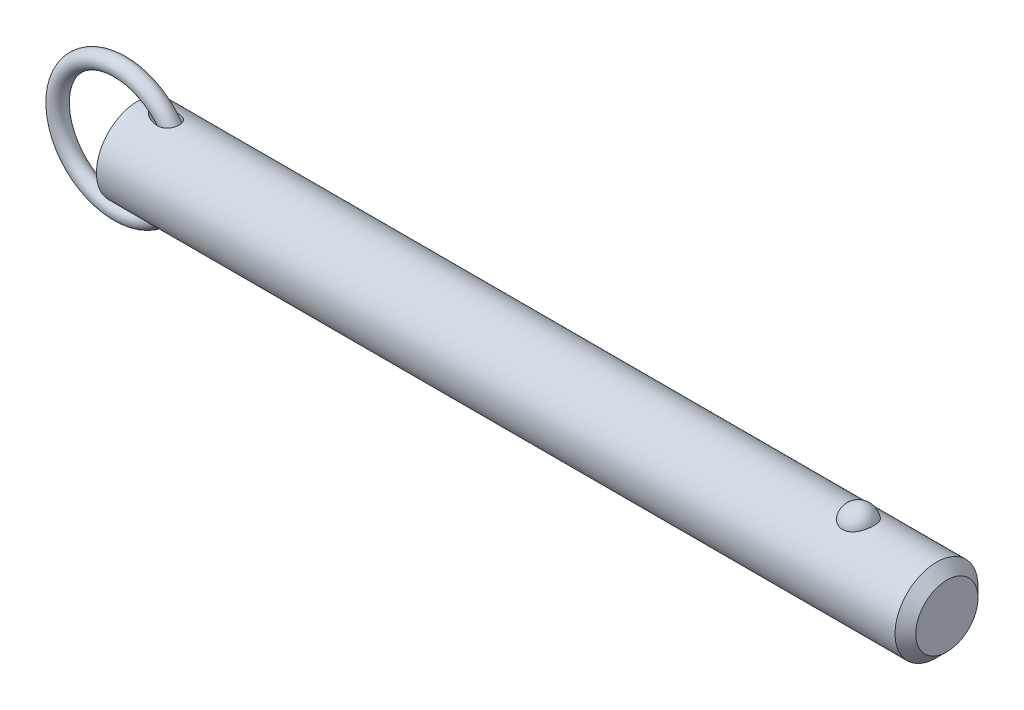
ISO-10303-21;
HEADER;
FILE_DESCRIPTION(('STEP AP214'),'2;1');
FILE_NAME('part.step','',(''),(''),'','','');
FILE_SCHEMA(('AUTOMOTIVE_DESIGN { 1 0 10303 214 1 1 1 1 }'));
ENDSEC;
DATA;
#1=APPLICATION_CONTEXT('core data for automotive mechanical design processes');
#2=APPLICATION_PROTOCOL_DEFINITION('international standard','automotive_design',2000,#1);
#3=PRODUCT_CONTEXT('',#1,'mechanical');
#4=PRODUCT('Part','Part','',(#3));
#5=PRODUCT_RELATED_PRODUCT_CATEGORY('part','',(#4));
#6=PRODUCT_DEFINITION_FORMATION('','',#4);
#7=PRODUCT_DEFINITION_CONTEXT('part definition',#1,'design');
#8=PRODUCT_DEFINITION('design','',#6,#7);
#9=PRODUCT_DEFINITION_SHAPE('','',#8);
#10=(LENGTH_UNIT() NAMED_UNIT(*) SI_UNIT(.MILLI.,.METRE.));
#11=(NAMED_UNIT(*) PLANE_ANGLE_UNIT() SI_UNIT($,.RADIAN.));
#12=(NAMED_UNIT(*) SI_UNIT($,.STERADIAN.) SOLID_ANGLE_UNIT());
#13=UNCERTAINTY_MEASURE_WITH_UNIT(LENGTH_MEASURE(1.E-05),#10,'distance_accuracy_value','');
#14=(GEOMETRIC_REPRESENTATION_CONTEXT(3) GLOBAL_UNCERTAINTY_ASSIGNED_CONTEXT((#13)) GLOBAL_UNIT_ASSIGNED_CONTEXT((#10,
#11,#12)) REPRESENTATION_CONTEXT('',''));
#15=CARTESIAN_POINT('',(0.,0.,0.));
#16=DIRECTION('',(0.,0.,1.));
#17=DIRECTION('',(1.,0.,0.));
#18=AXIS2_PLACEMENT_3D('',#15,#16,#17);
#19=CARTESIAN_POINT('',(-5.53898640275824,0.,0.));
#20=DIRECTION('',(0.,0.,1.));
#21=DIRECTION('',(1.,0.,0.));
#22=AXIS2_PLACEMENT_3D('',#19,#20,#21);
#23=TOROIDAL_SURFACE('',#22,19.05,2.54);
#24=CARTESIAN_POINT('',(16.0510135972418,0.,0.));
#25=VERTEX_POINT('',#24);
#26=VERTEX_LOOP('',#25);
#27=FACE_BOUND('',#26,.T.);
#28=ADVANCED_FACE('P0_F12',(#27),#23,.T.);
#29=CLOSED_SHELL('',(#28));
#30=MANIFOLD_SOLID_BREP('P0_B1',#29);
#31=CARTESIAN_POINT('',(0.,0.,0.));
#32=DIRECTION('',(1.,0.,0.));
#33=DIRECTION('',(0.,0.,-1.));
#34=AXIS2_PLACEMENT_3D('',#31,#32,#33);
#35=CYLINDRICAL_SURFACE('',#34,12.7);
#36=CARTESIAN_POINT('',(244.475,0.,0.));
#37=DIRECTION('',(1.,0.,0.));
#38=DIRECTION('',(0.,0.,-1.));
#39=AXIS2_PLACEMENT_3D('',#36,#37,#38);
#40=CIRCLE('',#39,12.7);
#41=CARTESIAN_POINT('',(244.475,0.,-12.7));
#42=VERTEX_POINT('',#41);
#43=EDGE_CURVE('P1_E89',#42,#42,#40,.T.);
#44=ORIENTED_EDGE('',*,*,#43,.F.);
#45=EDGE_LOOP('',(#44));
#46=FACE_BOUND('',#45,.T.);
#47=CARTESIAN_POINT('',(0.,0.,0.));
#48=DIRECTION('',(1.,0.,0.));
#49=DIRECTION('',(0.,0.,-1.));
#50=AXIS2_PLACEMENT_3D('',#47,#48,#49);
#51=CIRCLE('',#50,12.7);
#52=CARTESIAN_POINT('',(0.,0.,-12.7));
#53=VERTEX_POINT('',#52);
#54=EDGE_CURVE('P1_E52',#53,#53,#51,.T.);
#55=ORIENTED_EDGE('',*,*,#54,.T.);
#56=EDGE_LOOP('',(#55));
#57=FACE_BOUND('',#56,.T.);
#58=CARTESIAN_POINT('',(220.560042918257,11.7500437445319,4.81938502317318));
#59=CARTESIAN_POINT('',(220.435088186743,11.7500430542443,4.81938571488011));
#60=CARTESIAN_POINT('',(220.310144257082,11.7520975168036,4.81438658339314));
#61=CARTESIAN_POINT('',(220.061142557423,11.760253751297,4.79442904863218));
#62=CARTESIAN_POINT('',(219.937085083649,11.7663568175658,4.77946746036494));
#63=CARTESIAN_POINT('',(219.690901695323,11.7824262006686,4.73971414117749));
#64=CARTESIAN_POINT('',(219.568774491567,11.7923898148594,4.71492928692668));
#65=CARTESIAN_POINT('',(219.327187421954,11.8158938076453,4.65571340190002));
#66=CARTESIAN_POINT('',(219.20772859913,11.8294355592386,4.6212786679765));
#67=CARTESIAN_POINT('',(218.972557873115,11.8596812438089,4.54309502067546));
#68=CARTESIAN_POINT('',(218.856839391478,11.8763792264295,4.49936361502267));
#69=CARTESIAN_POINT('',(218.629653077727,11.9124878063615,4.40287235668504));
#70=CARTESIAN_POINT('',(218.518186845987,11.9318994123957,4.35010914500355));
#71=CARTESIAN_POINT('',(218.191278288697,11.9934256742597,4.17881316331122));
#72=CARTESIAN_POINT('',(217.983127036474,12.038858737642,4.04720756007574));
#73=CARTESIAN_POINT('',(217.585850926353,12.1352173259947,3.748564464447));
#74=CARTESIAN_POINT('',(217.397443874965,12.1862630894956,3.58061821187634));
#75=CARTESIAN_POINT('',(217.050521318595,12.2875163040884,3.21600758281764));
#76=CARTESIAN_POINT('',(216.892011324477,12.3377235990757,3.01933792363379));
#77=CARTESIAN_POINT('',(216.60168878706,12.4344923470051,2.59291655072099));
#78=CARTESIAN_POINT('',(216.471376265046,12.4807925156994,2.36208286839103));
#79=CARTESIAN_POINT('',(216.249407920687,12.5623454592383,1.88070399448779));
#80=CARTESIAN_POINT('',(216.157755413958,12.5975972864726,1.63015711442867));
#81=CARTESIAN_POINT('',(216.014046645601,12.6538414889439,1.1129886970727));
#82=CARTESIAN_POINT('',(215.962499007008,12.6746503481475,0.84620552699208));
#83=CARTESIAN_POINT('',(215.901977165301,12.699153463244,0.307085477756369));
#84=CARTESIAN_POINT('',(215.893001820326,12.7028481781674,0.0347487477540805));
#85=CARTESIAN_POINT('',(215.917731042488,12.6927785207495,-0.506073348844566));
#86=CARTESIAN_POINT('',(215.951189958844,12.6791146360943,-0.774571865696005));
#87=CARTESIAN_POINT('',(216.059687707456,12.635882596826,-1.30170246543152));
#88=CARTESIAN_POINT('',(216.13472729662,12.606314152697,-1.56033436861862));
#89=CARTESIAN_POINT('',(216.32500006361,12.5342328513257,-2.0608389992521));
#90=CARTESIAN_POINT('',(216.440287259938,12.4917026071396,-2.30268867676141));
#91=CARTESIAN_POINT('',(216.708704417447,12.3981123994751,-2.76259600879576));
#92=CARTESIAN_POINT('',(216.861837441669,12.3470517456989,-2.98065173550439));
#93=CARTESIAN_POINT('',(217.203507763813,12.2416045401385,-3.38786328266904));
#94=CARTESIAN_POINT('',(217.392201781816,12.1872040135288,-3.57688418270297));
#95=CARTESIAN_POINT('',(217.800239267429,12.0814086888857,-3.91941073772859));
#96=CARTESIAN_POINT('',(218.019580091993,12.0300136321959,-4.07291945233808));
#97=CARTESIAN_POINT('',(218.478375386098,11.9373542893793,-4.33691289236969));
#98=CARTESIAN_POINT('',(218.717304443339,11.8958982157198,-4.44824125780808));
#99=CARTESIAN_POINT('',(219.21243761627,11.8268116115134,-4.62881985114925));
#100=CARTESIAN_POINT('',(219.468635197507,11.7991758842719,-4.69808589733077));
#101=CARTESIAN_POINT('',(219.977164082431,11.7622209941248,-4.78983181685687));
#102=CARTESIAN_POINT('',(220.229041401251,11.7520502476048,-4.81449025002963));
#103=CARTESIAN_POINT('',(220.733573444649,11.7485796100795,-4.82295735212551));
#104=CARTESIAN_POINT('',(220.986228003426,11.7552763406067,-4.80677420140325));
#105=CARTESIAN_POINT('',(221.476834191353,11.7842584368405,-4.73525430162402));
#106=CARTESIAN_POINT('',(221.714998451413,11.8060486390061,-4.68116061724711));
#107=CARTESIAN_POINT('',(222.178489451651,11.8622750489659,-4.53678133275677));
#108=CARTESIAN_POINT('',(222.403815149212,11.8967122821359,-4.44649279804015));
#109=CARTESIAN_POINT('',(222.840801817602,11.9754603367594,-4.22987613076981));
#110=CARTESIAN_POINT('',(223.052057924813,12.0199699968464,-4.10280539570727));
#111=CARTESIAN_POINT('',(223.450601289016,12.1138028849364,-3.81685409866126));
#112=CARTESIAN_POINT('',(223.637883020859,12.163127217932,-3.65796622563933));
#113=CARTESIAN_POINT('',(223.993350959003,12.2642343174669,-3.30364864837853));
#114=CARTESIAN_POINT('',(224.160111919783,12.3160165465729,-3.10678783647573));
#115=CARTESIAN_POINT('',(224.459579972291,12.4142566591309,-2.68748409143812));
#116=CARTESIAN_POINT('',(224.592280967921,12.4607135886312,-2.4650365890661));
#117=CARTESIAN_POINT('',(224.824691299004,12.5450236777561,-1.9928951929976));
#118=CARTESIAN_POINT('',(224.923215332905,12.5825557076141,-1.74255918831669));
#119=CARTESIAN_POINT('',(225.079227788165,12.6431720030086,-1.22773734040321));
#120=CARTESIAN_POINT('',(225.136715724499,12.6662560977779,-0.963251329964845));
#121=CARTESIAN_POINT('',(225.209544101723,12.6956486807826,-0.427355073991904));
#122=CARTESIAN_POINT('',(225.224837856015,12.7019385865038,-0.155937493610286));
#123=CARTESIAN_POINT('',(225.212779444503,12.6970201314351,0.385928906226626));
#124=CARTESIAN_POINT('',(225.18542805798,12.6858120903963,0.656377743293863));
#125=CARTESIAN_POINT('',(225.113060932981,12.6568455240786,1.05454017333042));
#126=CARTESIAN_POINT('',(225.083796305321,12.6451962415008,1.185778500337));
#127=CARTESIAN_POINT('',(225.015022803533,12.6181819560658,1.4451380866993));
#128=CARTESIAN_POINT('',(224.975517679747,12.6028183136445,1.57326046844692));
#129=CARTESIAN_POINT('',(224.886439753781,12.5687547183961,1.82554978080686));
#130=CARTESIAN_POINT('',(224.836862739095,12.5500533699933,1.9497150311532));
#131=CARTESIAN_POINT('',(224.72792115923,12.5098093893,2.19314370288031));
#132=CARTESIAN_POINT('',(224.668560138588,12.4882677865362,2.31240887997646));
#133=CARTESIAN_POINT('',(224.53997128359,12.4427679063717,2.54593031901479));
#134=CARTESIAN_POINT('',(224.470688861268,12.4187964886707,2.66015396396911));
#135=CARTESIAN_POINT('',(224.322903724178,12.3691892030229,2.88202659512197));
#136=CARTESIAN_POINT('',(224.244404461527,12.3435539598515,2.98967802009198));
#137=CARTESIAN_POINT('',(224.078550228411,12.2912955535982,3.19774385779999));
#138=CARTESIAN_POINT('',(223.991191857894,12.2646720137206,3.29815546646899));
#139=CARTESIAN_POINT('',(223.808161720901,12.2111945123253,3.49095035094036));
#140=CARTESIAN_POINT('',(223.712493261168,12.1843406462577,3.58333679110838));
#141=CARTESIAN_POINT('',(223.513627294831,12.1312249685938,3.75922876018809));
#142=CARTESIAN_POINT('',(223.410450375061,12.104961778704,3.84275713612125));
#143=CARTESIAN_POINT('',(223.19701336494,12.0537284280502,4.00056406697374));
#144=CARTESIAN_POINT('',(223.086756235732,12.028757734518,4.07484645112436));
#145=CARTESIAN_POINT('',(222.859755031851,11.9808306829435,4.21367959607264));
#146=CARTESIAN_POINT('',(222.743006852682,11.9578756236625,4.27822410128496));
#147=CARTESIAN_POINT('',(222.50394258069,11.9147184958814,4.39698483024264));
#148=CARTESIAN_POINT('',(222.381628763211,11.894515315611,4.45120522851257));
#149=CARTESIAN_POINT('',(222.122952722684,11.8561129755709,4.55255353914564));
#150=CARTESIAN_POINT('',(221.986223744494,11.8381764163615,4.59884858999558));
#151=CARTESIAN_POINT('',(221.708608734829,11.8069093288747,4.67853897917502));
#152=CARTESIAN_POINT('',(221.567724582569,11.7935767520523,4.71194005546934));
#153=CARTESIAN_POINT('',(221.28309446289,11.7720277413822,4.76552188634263));
#154=CARTESIAN_POINT('',(221.139348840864,11.7638106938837,4.78570422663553));
#155=CARTESIAN_POINT('',(220.850411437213,11.7528195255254,4.81263433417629));
#156=CARTESIAN_POINT('',(220.705219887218,11.7500445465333,4.81938421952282));
#157=CARTESIAN_POINT('',(220.560042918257,11.7500437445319,4.81938502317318));
#158=B_SPLINE_CURVE_WITH_KNOTS('',3,(#58,#59,#60,#61,#62,#63,#64,#65,#66,#67,#68,#69,#70,#71,
#72,#73,#74,#75,#76,#77,#78,#79,#80,#81,#82,#83,#84,#85,#86,#87,#88,#89,#90,#91,#92,#93,#94,#95,
#96,#97,#98,#99,#100,#101,#102,#103,#104,#105,#106,#107,#108,#109,#110,#111,#112,#113,#114,#115,
#116,#117,#118,#119,#120,#121,#122,#123,#124,#125,#126,#127,#128,#129,#130,#131,#132,#133,#134,
#135,#136,#137,#138,#139,#140,#141,#142,#143,#144,#145,#146,#147,#148,#149,#150,#151,#152,#153,
#154,#155,#156,#157),.UNSPECIFIED.,.T.,.F.,(4,2,2,2,2,2,2,2,2,2,2,2,2,2,2,2,2,2,2,2,2,2,2,2,2,2,
2,2,2,2,2,2,2,2,2,2,2,2,2,2,2,2,2,2,2,2,2,2,2,4),(0.,0.374729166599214,0.749578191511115,
1.12416526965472,1.49889629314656,1.87292776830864,2.24709865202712,2.99481328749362,
3.76399449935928,4.53331735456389,5.33683915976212,6.14042986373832,6.95405296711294,
7.76765424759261,8.57656703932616,9.3854945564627,10.1955119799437,11.0055949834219,
11.8193353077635,12.6330054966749,13.4294141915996,14.2255231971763,14.9815786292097,
15.7374826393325,16.4696948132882,17.2019663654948,17.9501979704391,18.6986017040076,
19.4844704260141,20.2704797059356,21.0815215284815,21.8925729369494,22.7045213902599,
23.5164550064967,23.9209608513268,24.3253187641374,24.7298461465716,25.1342272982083,
25.54092555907,25.9474719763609,26.3541750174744,26.7607169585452,27.1661834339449,
27.5714814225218,27.9770386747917,28.3824315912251,28.8181206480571,29.2536155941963,
29.6890582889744,30.1244323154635),.UNSPECIFIED.);
#159=CARTESIAN_POINT('',(220.560042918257,11.7500437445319,4.81938502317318));
#160=VERTEX_POINT('',#159);
#161=EDGE_CURVE('P1_E80',#160,#160,#158,.T.);
#162=ORIENTED_EDGE('',*,*,#161,.T.);
#163=EDGE_LOOP('',(#162));
#164=FACE_BOUND('',#163,.T.);
#165=CARTESIAN_POINT('',(-5.53898640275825,0.,0.));
#166=DIRECTION('',(0.796400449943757,-0.604769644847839,0.));
#167=DIRECTION('',(0.604769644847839,0.796400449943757,0.));
#168=AXIS2_PLACEMENT_3D('',#165,#166,#167);
#169=ELLIPSE('',#168,15.9467514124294,12.7);
#170=CARTESIAN_POINT('',(4.0948214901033,12.6864319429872,0.586893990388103));
#171=VERTEX_POINT('',#170);
#172=CARTESIAN_POINT('',(4.0948214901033,12.6864319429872,-0.586893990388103));
#173=VERTEX_POINT('',#172);
#174=EDGE_CURVE('P1_E47',#171,#173,#169,.F.);
#175=ORIENTED_EDGE('',*,*,#174,.T.);
#176=CARTESIAN_POINT('',(4.06153170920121,12.6905758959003,-0.48916605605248));
#177=CARTESIAN_POINT('',(4.08111374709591,12.6881366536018,-0.552489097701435));
#178=CARTESIAN_POINT('',(4.10417851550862,12.6852663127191,-0.614604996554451));
#179=CARTESIAN_POINT('',(4.15628434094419,12.6787965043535,-0.736067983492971));
#180=CARTESIAN_POINT('',(4.18531032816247,12.6751988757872,-0.795421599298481));
#181=CARTESIAN_POINT('',(4.27911159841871,12.6636052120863,-0.967590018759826));
#182=CARTESIAN_POINT('',(4.35123408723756,12.654730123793,-1.07635920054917));
#183=CARTESIAN_POINT('',(4.49106800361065,12.6376715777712,-1.25922957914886));
#184=CARTESIAN_POINT('',(4.55601066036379,12.6297947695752,-1.33556751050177));
#185=CARTESIAN_POINT('',(4.69223626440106,12.6134116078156,-1.48232741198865));
#186=CARTESIAN_POINT('',(4.76352147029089,12.6049050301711,-1.55274725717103));
#187=CARTESIAN_POINT('',(4.91163946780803,12.587417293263,-1.68868704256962));
#188=CARTESIAN_POINT('',(4.98851399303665,12.5784327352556,-1.75416062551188));
#189=CARTESIAN_POINT('',(5.14630057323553,12.560235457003,-1.88003275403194));
#190=CARTESIAN_POINT('',(5.22721398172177,12.5510226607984,-1.94042957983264));
#191=CARTESIAN_POINT('',(5.45368877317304,12.5256514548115,-2.09966332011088));
#192=CARTESIAN_POINT('',(5.60261616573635,12.5094182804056,-2.19371988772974));
#193=CARTESIAN_POINT('',(5.90795545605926,12.4774211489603,-2.36893890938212));
#194=CARTESIAN_POINT('',(6.06437232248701,12.4616575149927,-2.45009264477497));
#195=CARTESIAN_POINT('',(6.38306132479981,12.431227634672,-2.60008249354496));
#196=CARTESIAN_POINT('',(6.54533237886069,12.4165611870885,-2.66892086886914));
#197=CARTESIAN_POINT('',(6.87462618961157,12.3889351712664,-2.79435199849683));
#198=CARTESIAN_POINT('',(7.0416477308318,12.3759751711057,-2.85094785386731));
#199=CARTESIAN_POINT('',(7.38726647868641,12.3518460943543,-2.95377962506));
#200=CARTESIAN_POINT('',(7.56604577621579,12.3407843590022,-2.9994320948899));
#201=CARTESIAN_POINT('',(7.92698692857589,12.3219309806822,-3.07596683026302));
#202=CARTESIAN_POINT('',(8.10914972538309,12.314140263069,-3.1068449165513));
#203=CARTESIAN_POINT('',(8.47511457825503,12.3025918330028,-3.15226850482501));
#204=CARTESIAN_POINT('',(8.6589097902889,12.2988216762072,-3.16686440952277));
#205=CARTESIAN_POINT('',(9.02696087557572,12.2959421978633,-3.17802250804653));
#206=CARTESIAN_POINT('',(9.21121628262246,12.2968292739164,-3.17459864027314));
#207=CARTESIAN_POINT('',(9.61636263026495,12.3045198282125,-3.14471110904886));
#208=CARTESIAN_POINT('',(9.83695552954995,12.3125080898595,-3.1136323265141));
#209=CARTESIAN_POINT('',(10.1619126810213,12.3303028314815,-3.04206574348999));
#210=CARTESIAN_POINT('',(10.2692747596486,12.3372061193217,-3.01403983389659));
#211=CARTESIAN_POINT('',(10.4811758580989,12.3528538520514,-2.94925947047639));
#212=CARTESIAN_POINT('',(10.5857162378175,12.361597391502,-2.91250930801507));
#213=CARTESIAN_POINT('',(10.7921321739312,12.3808585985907,-2.82951748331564));
#214=CARTESIAN_POINT('',(10.8939665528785,12.3913944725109,-2.78317723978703));
#215=CARTESIAN_POINT('',(11.0926118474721,12.4138762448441,-2.68112002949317));
#216=CARTESIAN_POINT('',(11.1894254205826,12.4258213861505,-2.62540809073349));
#217=CARTESIAN_POINT('',(11.3768740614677,12.4507225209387,-2.5046565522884));
#218=CARTESIAN_POINT('',(11.46751150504,12.4636781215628,-2.43962056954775));
#219=CARTESIAN_POINT('',(11.6414572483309,12.4901070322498,-2.30048560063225));
#220=CARTESIAN_POINT('',(11.7247669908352,12.5035802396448,-2.2263884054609));
#221=CARTESIAN_POINT('',(11.8713131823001,12.5285000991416,-2.08117367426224));
#222=CARTESIAN_POINT('',(11.9357009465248,12.5399538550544,-2.0112159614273));
#223=CARTESIAN_POINT('',(12.0576805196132,12.5624496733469,-1.86555293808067));
#224=CARTESIAN_POINT('',(12.1152732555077,12.5734917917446,-1.78984841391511));
#225=CARTESIAN_POINT('',(12.2230738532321,12.5947858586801,-1.63327883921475));
#226=CARTESIAN_POINT('',(12.2732844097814,12.6050380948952,-1.55241568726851));
#227=CARTESIAN_POINT('',(12.3658430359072,12.6243983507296,-1.38621267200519));
#228=CARTESIAN_POINT('',(12.4081916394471,12.6335064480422,-1.30087311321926));
#229=CARTESIAN_POINT('',(12.5150098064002,12.6569076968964,-1.05702619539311));
#230=CARTESIAN_POINT('',(12.5703399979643,12.6695746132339,-0.894232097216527));
#231=CARTESIAN_POINT('',(12.6526225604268,12.6886816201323,-0.561391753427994));
#232=CARTESIAN_POINT('',(12.6795825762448,12.6951233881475,-0.391347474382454));
#233=CARTESIAN_POINT('',(12.7041016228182,12.7009766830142,-0.0537636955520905));
#234=CARTESIAN_POINT('',(12.7024538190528,12.7005778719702,0.113714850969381));
#235=CARTESIAN_POINT('',(12.6717240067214,12.6932548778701,0.445979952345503));
#236=CARTESIAN_POINT('',(12.6426435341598,12.6863310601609,0.610766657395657));
#237=CARTESIAN_POINT('',(12.5579769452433,12.6667465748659,0.932429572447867));
#238=CARTESIAN_POINT('',(12.5024793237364,12.6541050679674,1.08933027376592));
#239=CARTESIAN_POINT('',(12.3665691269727,12.6244558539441,1.39146752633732));
#240=CARTESIAN_POINT('',(12.2861577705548,12.6074483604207,1.53670464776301));
#241=CARTESIAN_POINT('',(12.1018203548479,12.5706804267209,1.81319588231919));
#242=CARTESIAN_POINT('',(11.9976588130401,12.5508932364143,1.94428915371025));
#243=CARTESIAN_POINT('',(11.7695265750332,12.5107540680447,2.18776051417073));
#244=CARTESIAN_POINT('',(11.6455540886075,12.4904020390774,2.30013691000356));
#245=CARTESIAN_POINT('',(11.3759347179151,12.4502278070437,2.50870972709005));
#246=CARTESIAN_POINT('',(11.2295880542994,12.4304654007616,2.60400962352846));
#247=CARTESIAN_POINT('',(10.9239803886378,12.3941696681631,2.7716292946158));
#248=CARTESIAN_POINT('',(10.7647152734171,12.3776373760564,2.84394171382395));
#249=CARTESIAN_POINT('',(10.4192039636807,12.3473062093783,2.9730352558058));
#250=CARTESIAN_POINT('',(10.231933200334,12.3340204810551,3.02717164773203));
#251=CARTESIAN_POINT('',(9.85152982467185,12.3134301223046,3.10986173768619));
#252=CARTESIAN_POINT('',(9.65839336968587,12.3061295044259,3.13839827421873));
#253=CARTESIAN_POINT('',(9.31022514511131,12.2982822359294,3.16897517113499));
#254=CARTESIAN_POINT('',(9.15555718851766,12.2966525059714,3.1752689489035));
#255=CARTESIAN_POINT('',(8.84618945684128,12.2967963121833,3.17471335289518));
#256=CARTESIAN_POINT('',(8.69148970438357,12.2985715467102,3.16785742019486));
#257=CARTESIAN_POINT('',(8.3828047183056,12.3051648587,3.14214692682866));
#258=CARTESIAN_POINT('',(8.22882218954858,12.3099904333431,3.12326280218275));
#259=CARTESIAN_POINT('',(7.92276070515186,12.3222644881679,3.07448013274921));
#260=CARTESIAN_POINT('',(7.77068148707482,12.3297126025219,3.04458312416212));
#261=CARTESIAN_POINT('',(7.46452663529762,12.3470493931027,2.97350781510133));
#262=CARTESIAN_POINT('',(7.31052714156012,12.3570043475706,2.93201910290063));
#263=CARTESIAN_POINT('',(7.00579083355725,12.3787609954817,2.83876185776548));
#264=CARTESIAN_POINT('',(6.85505451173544,12.3905629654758,2.78699178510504));
#265=CARTESIAN_POINT('',(6.55781208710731,12.415528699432,2.67357744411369));
#266=CARTESIAN_POINT('',(6.41129783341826,12.4286895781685,2.61195394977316));
#267=CARTESIAN_POINT('',(6.12302950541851,12.4559398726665,2.47874512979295));
#268=CARTESIAN_POINT('',(5.98127390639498,12.4700289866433,2.40716303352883));
#269=CARTESIAN_POINT('',(5.67073126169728,12.5020754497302,2.23550426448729));
#270=CARTESIAN_POINT('',(5.50343839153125,12.5201625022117,2.13268685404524));
#271=CARTESIAN_POINT('',(5.26147616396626,12.5471537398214,1.96522579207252));
#272=CARTESIAN_POINT('',(5.18224299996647,12.5561365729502,1.90713440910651));
#273=CARTESIAN_POINT('',(5.02746475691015,12.573912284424,1.78618989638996));
#274=CARTESIAN_POINT('',(4.95191912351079,12.5827051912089,1.72333748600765));
#275=CARTESIAN_POINT('',(4.8178716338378,12.598469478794,1.60360864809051));
#276=CARTESIAN_POINT('',(4.75865966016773,12.6054958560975,1.54753994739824));
#277=CARTESIAN_POINT('',(4.64406285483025,12.6191906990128,1.43158546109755));
#278=CARTESIAN_POINT('',(4.5886792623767,12.6258590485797,1.37169845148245));
#279=CARTESIAN_POINT('',(4.43014912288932,12.6450546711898,1.18656670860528));
#280=CARTESIAN_POINT('',(4.3337272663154,12.6568788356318,1.05507993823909));
#281=CARTESIAN_POINT('',(4.21252055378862,12.6718304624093,0.84805289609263));
#282=CARTESIAN_POINT('',(4.17660155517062,12.6762773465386,0.779100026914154));
#283=CARTESIAN_POINT('',(4.11264979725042,12.6842122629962,0.637080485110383));
#284=CARTESIAN_POINT('',(4.08466792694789,12.6876941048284,0.563990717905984));
#285=CARTESIAN_POINT('',(4.06153170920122,12.6905758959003,0.489166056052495));
#286=B_SPLINE_CURVE_WITH_KNOTS('',3,(#176,#177,#178,#179,#180,#181,#182,#183,#184,#185,#186,
#187,#188,#189,#190,#191,#192,#193,#194,#195,#196,#197,#198,#199,#200,#201,#202,#203,#204,#205,
#206,#207,#208,#209,#210,#211,#212,#213,#214,#215,#216,#217,#218,#219,#220,#221,#222,#223,#224,
#225,#226,#227,#228,#229,#230,#231,#232,#233,#234,#235,#236,#237,#238,#239,#240,#241,#242,#243,
#244,#245,#246,#247,#248,#249,#250,#251,#252,#253,#254,#255,#256,#257,#258,#259,#260,#261,#262,
#263,#264,#265,#266,#267,#268,#269,#270,#271,#272,#273,#274,#275,#276,#277,#278,#279,#280,#281,
#282,#283,#284,#285),.UNSPECIFIED.,.F.,.F.,(4,2,2,2,2,2,2,2,2,2,2,2,2,2,2,2,2,2,2,2,2,2,2,2,2,2,
2,2,2,2,2,2,2,2,2,2,2,2,2,2,2,2,2,2,2,2,2,2,2,2,2,2,2,2,4),(0.,0.198708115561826,
0.39691995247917,0.787580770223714,1.08882492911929,1.39017679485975,1.69407136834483,
1.99806847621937,2.52793143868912,3.05815092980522,3.58827293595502,4.11826050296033,
4.67218806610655,5.22627222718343,5.77863637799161,6.3305733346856,6.99657211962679,
7.32977411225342,7.66281254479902,7.99946156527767,8.33593054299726,8.67226935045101,
9.00854178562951,9.29544181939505,9.58230266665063,9.86905853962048,10.1557949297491,
10.6702338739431,11.1845341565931,11.6845985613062,12.1846349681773,12.6830079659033,
13.1813565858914,13.68487951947,14.1884479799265,14.713533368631,15.2387866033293,
15.8228373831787,16.407279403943,16.8710810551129,17.3351141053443,17.8002921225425,
18.2654052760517,18.7444169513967,19.2235004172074,19.701586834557,20.1795185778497,
20.7699825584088,21.0658110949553,21.3615950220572,21.606957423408,21.8523988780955,
22.3397467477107,22.5729183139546,22.8075527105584),.UNSPECIFIED.);
#287=EDGE_CURVE('P1_E51',#173,#171,#286,.T.);
#288=ORIENTED_EDGE('',*,*,#287,.T.);
#289=EDGE_LOOP('',(#175,#288));
#290=FACE_BOUND('',#289,.T.);
#291=CARTESIAN_POINT('',(-5.53898640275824,0.,0.));
#292=DIRECTION('',(-0.796400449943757,-0.604769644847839,0.));
#293=DIRECTION('',(0.604769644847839,-0.796400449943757,0.));
#294=AXIS2_PLACEMENT_3D('',#291,#292,#293);
#295=ELLIPSE('',#294,15.9467514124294,12.7);
#296=CARTESIAN_POINT('',(4.09482149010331,-12.6864319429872,0.586893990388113));
#297=VERTEX_POINT('',#296);
#298=CARTESIAN_POINT('',(4.09482149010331,-12.6864319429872,-0.586893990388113));
#299=VERTEX_POINT('',#298);
#300=EDGE_CURVE('P1_E28',#297,#299,#295,.F.);
#301=ORIENTED_EDGE('',*,*,#300,.F.);
#302=CARTESIAN_POINT('',(4.06153170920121,-12.6905758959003,0.489166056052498));
#303=CARTESIAN_POINT('',(4.08111374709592,-12.6881366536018,0.552489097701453));
#304=CARTESIAN_POINT('',(4.10417851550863,-12.6852663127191,0.614604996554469));
#305=CARTESIAN_POINT('',(4.1562843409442,-12.6787965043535,0.736067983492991));
#306=CARTESIAN_POINT('',(4.18531032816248,-12.6751988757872,0.795421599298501));
#307=CARTESIAN_POINT('',(4.27911159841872,-12.6636052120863,0.96759001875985));
#308=CARTESIAN_POINT('',(4.35123408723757,-12.654730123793,1.07635920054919));
#309=CARTESIAN_POINT('',(4.49106800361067,-12.6376715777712,1.25922957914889));
#310=CARTESIAN_POINT('',(4.55601066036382,-12.6297947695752,1.33556751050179));
#311=CARTESIAN_POINT('',(4.69223626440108,-12.6134116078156,1.48232741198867));
#312=CARTESIAN_POINT('',(4.76352147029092,-12.6049050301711,1.55274725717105));
#313=CARTESIAN_POINT('',(4.91163946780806,-12.587417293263,1.68868704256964));
#314=CARTESIAN_POINT('',(4.98851399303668,-12.5784327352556,1.7541606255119));
#315=CARTESIAN_POINT('',(5.14630057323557,-12.560235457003,1.88003275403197));
#316=CARTESIAN_POINT('',(5.2272139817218,-12.5510226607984,1.94042957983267));
#317=CARTESIAN_POINT('',(5.45368877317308,-12.5256514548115,2.09966332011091));
#318=CARTESIAN_POINT('',(5.6026161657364,-12.5094182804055,2.19371988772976));
#319=CARTESIAN_POINT('',(5.90795545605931,-12.4774211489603,2.36893890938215));
#320=CARTESIAN_POINT('',(6.06437232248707,-12.4616575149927,2.450092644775));
#321=CARTESIAN_POINT('',(6.38306132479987,-12.431227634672,2.60008249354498));
#322=CARTESIAN_POINT('',(6.54533237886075,-12.4165611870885,2.66892086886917));
#323=CARTESIAN_POINT('',(6.87462618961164,-12.3889351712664,2.79435199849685));
#324=CARTESIAN_POINT('',(7.04164773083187,-12.3759751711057,2.85094785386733));
#325=CARTESIAN_POINT('',(7.38726647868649,-12.3518460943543,2.95377962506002));
#326=CARTESIAN_POINT('',(7.56604577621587,-12.3407843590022,2.99943209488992));
#327=CARTESIAN_POINT('',(7.92698692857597,-12.3219309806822,3.07596683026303));
#328=CARTESIAN_POINT('',(8.10914972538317,-12.314140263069,3.10684491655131));
#329=CARTESIAN_POINT('',(8.47511457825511,-12.3025918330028,3.15226850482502));
#330=CARTESIAN_POINT('',(8.65890979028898,-12.2988216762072,3.16686440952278));
#331=CARTESIAN_POINT('',(9.02696087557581,-12.2959421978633,3.17802250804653));
#332=CARTESIAN_POINT('',(9.21121628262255,-12.2968292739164,3.17459864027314));
#333=CARTESIAN_POINT('',(9.61636263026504,-12.3045198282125,3.14471110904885));
#334=CARTESIAN_POINT('',(9.83695552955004,-12.3125080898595,3.11363232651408));
#335=CARTESIAN_POINT('',(10.1619126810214,-12.3303028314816,3.04206574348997));
#336=CARTESIAN_POINT('',(10.2692747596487,-12.3372061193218,3.01403983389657));
#337=CARTESIAN_POINT('',(10.481175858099,-12.3528538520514,2.94925947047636));
#338=CARTESIAN_POINT('',(10.5857162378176,-12.361597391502,2.91250930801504));
#339=CARTESIAN_POINT('',(10.7921321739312,-12.3808585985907,2.82951748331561));
#340=CARTESIAN_POINT('',(10.8939665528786,-12.3913944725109,2.783177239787));
#341=CARTESIAN_POINT('',(11.0926118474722,-12.4138762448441,2.68112002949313));
#342=CARTESIAN_POINT('',(11.1894254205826,-12.4258213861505,2.62540809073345));
#343=CARTESIAN_POINT('',(11.3768740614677,-12.4507225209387,2.50465655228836));
#344=CARTESIAN_POINT('',(11.4675115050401,-12.4636781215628,2.43962056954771));
#345=CARTESIAN_POINT('',(11.641457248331,-12.4901070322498,2.30048560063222));
#346=CARTESIAN_POINT('',(11.7247669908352,-12.5035802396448,2.22638840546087));
#347=CARTESIAN_POINT('',(11.8713131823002,-12.5285000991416,2.0811736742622));
#348=CARTESIAN_POINT('',(11.9357009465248,-12.5399538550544,2.01121596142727));
#349=CARTESIAN_POINT('',(12.0576805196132,-12.5624496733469,1.86555293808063));
#350=CARTESIAN_POINT('',(12.1152732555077,-12.5734917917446,1.78984841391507));
#351=CARTESIAN_POINT('',(12.2230738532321,-12.5947858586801,1.63327883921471));
#352=CARTESIAN_POINT('',(12.2732844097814,-12.6050380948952,1.55241568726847));
#353=CARTESIAN_POINT('',(12.3658430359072,-12.6243983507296,1.38621267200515));
#354=CARTESIAN_POINT('',(12.4081916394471,-12.6335064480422,1.30087311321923));
#355=CARTESIAN_POINT('',(12.5150098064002,-12.6569076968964,1.05702619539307));
#356=CARTESIAN_POINT('',(12.5703399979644,-12.6695746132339,0.894232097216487));
#357=CARTESIAN_POINT('',(12.6526225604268,-12.6886816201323,0.561391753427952));
#358=CARTESIAN_POINT('',(12.6795825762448,-12.6951233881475,0.391347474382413));
#359=CARTESIAN_POINT('',(12.7041016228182,-12.7009766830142,0.0537636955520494));
#360=CARTESIAN_POINT('',(12.7024538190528,-12.7005778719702,-0.113714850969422));
#361=CARTESIAN_POINT('',(12.6717240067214,-12.6932548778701,-0.445979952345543));
#362=CARTESIAN_POINT('',(12.6426435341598,-12.6863310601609,-0.610766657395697));
#363=CARTESIAN_POINT('',(12.5579769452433,-12.6667465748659,-0.932429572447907));
#364=CARTESIAN_POINT('',(12.5024793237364,-12.6541050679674,-1.08933027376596));
#365=CARTESIAN_POINT('',(12.3665691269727,-12.6244558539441,-1.39146752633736));
#366=CARTESIAN_POINT('',(12.2861577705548,-12.6074483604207,-1.53670464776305));
#367=CARTESIAN_POINT('',(12.1018203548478,-12.5706804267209,-1.81319588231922));
#368=CARTESIAN_POINT('',(11.99765881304,-12.5508932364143,-1.94428915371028));
#369=CARTESIAN_POINT('',(11.7695265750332,-12.5107540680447,-2.18776051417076));
#370=CARTESIAN_POINT('',(11.6455540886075,-12.4904020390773,-2.30013691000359));
#371=CARTESIAN_POINT('',(11.375934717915,-12.4502278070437,-2.50870972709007));
#372=CARTESIAN_POINT('',(11.2295880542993,-12.4304654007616,-2.60400962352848));
#373=CARTESIAN_POINT('',(10.9239803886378,-12.3941696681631,-2.77162929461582));
#374=CARTESIAN_POINT('',(10.764715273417,-12.3776373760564,-2.84394171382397));
#375=CARTESIAN_POINT('',(10.4192039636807,-12.3473062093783,-2.97303525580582));
#376=CARTESIAN_POINT('',(10.2319332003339,-12.3340204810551,-3.02717164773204));
#377=CARTESIAN_POINT('',(9.85152982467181,-12.3134301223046,-3.1098617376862));
#378=CARTESIAN_POINT('',(9.65839336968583,-12.3061295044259,-3.13839827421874));
#379=CARTESIAN_POINT('',(9.31022514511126,-12.2982822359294,-3.16897517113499));
#380=CARTESIAN_POINT('',(9.15555718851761,-12.2966525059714,-3.1752689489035));
#381=CARTESIAN_POINT('',(8.84618945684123,-12.2967963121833,-3.17471335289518));
#382=CARTESIAN_POINT('',(8.69148970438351,-12.2985715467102,-3.16785742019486));
#383=CARTESIAN_POINT('',(8.38280471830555,-12.3051648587,-3.14214692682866));
#384=CARTESIAN_POINT('',(8.22882218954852,-12.3099904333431,-3.12326280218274));
#385=CARTESIAN_POINT('',(7.9227607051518,-12.3222644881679,-3.0744801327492));
#386=CARTESIAN_POINT('',(7.77068148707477,-12.329712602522,-3.04458312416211));
#387=CARTESIAN_POINT('',(7.46452663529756,-12.3470493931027,-2.97350781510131));
#388=CARTESIAN_POINT('',(7.31052714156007,-12.3570043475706,-2.93201910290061));
#389=CARTESIAN_POINT('',(7.00579083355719,-12.3787609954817,-2.83876185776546));
#390=CARTESIAN_POINT('',(6.85505451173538,-12.3905629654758,-2.78699178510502));
#391=CARTESIAN_POINT('',(6.55781208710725,-12.415528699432,-2.67357744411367));
#392=CARTESIAN_POINT('',(6.41129783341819,-12.4286895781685,-2.61195394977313));
#393=CARTESIAN_POINT('',(6.12302950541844,-12.4559398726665,-2.47874512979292));
#394=CARTESIAN_POINT('',(5.98127390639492,-12.4700289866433,-2.40716303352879));
#395=CARTESIAN_POINT('',(5.67073126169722,-12.5020754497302,-2.23550426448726));
#396=CARTESIAN_POINT('',(5.50343839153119,-12.5201625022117,-2.13268685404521));
#397=CARTESIAN_POINT('',(5.26147616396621,-12.5471537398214,-1.96522579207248));
#398=CARTESIAN_POINT('',(5.18224299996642,-12.5561365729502,-1.90713440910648));
#399=CARTESIAN_POINT('',(5.02746475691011,-12.573912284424,-1.78618989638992));
#400=CARTESIAN_POINT('',(4.95191912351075,-12.5827051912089,-1.72333748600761));
#401=CARTESIAN_POINT('',(4.81787163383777,-12.598469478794,-1.60360864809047));
#402=CARTESIAN_POINT('',(4.75865966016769,-12.6054958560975,-1.5475399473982));
#403=CARTESIAN_POINT('',(4.64406285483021,-12.6191906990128,-1.43158546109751));
#404=CARTESIAN_POINT('',(4.58867926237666,-12.6258590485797,-1.37169845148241));
#405=CARTESIAN_POINT('',(4.4301491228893,-12.6450546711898,-1.18656670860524));
#406=CARTESIAN_POINT('',(4.33372726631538,-12.6568788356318,-1.05507993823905));
#407=CARTESIAN_POINT('',(4.21252055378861,-12.6718304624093,-0.848052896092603));
#408=CARTESIAN_POINT('',(4.1766015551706,-12.6762773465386,-0.779100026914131));
#409=CARTESIAN_POINT('',(4.1126497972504,-12.6842122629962,-0.637080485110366));
#410=CARTESIAN_POINT('',(4.08466792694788,-12.6876941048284,-0.563990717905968));
#411=CARTESIAN_POINT('',(4.06153170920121,-12.6905758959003,-0.489166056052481));
#412=B_SPLINE_CURVE_WITH_KNOTS('',3,(#302,#303,#304,#305,#306,#307,#308,#309,#310,#311,#312,
#313,#314,#315,#316,#317,#318,#319,#320,#321,#322,#323,#324,#325,#326,#327,#328,#329,#330,#331,
#332,#333,#334,#335,#336,#337,#338,#339,#340,#341,#342,#343,#344,#345,#346,#347,#348,#349,#350,
#351,#352,#353,#354,#355,#356,#357,#358,#359,#360,#361,#362,#363,#364,#365,#366,#367,#368,#369,
#370,#371,#372,#373,#374,#375,#376,#377,#378,#379,#380,#381,#382,#383,#384,#385,#386,#387,#388,
#389,#390,#391,#392,#393,#394,#395,#396,#397,#398,#399,#400,#401,#402,#403,#404,#405,#406,#407,
#408,#409,#410,#411),.UNSPECIFIED.,.F.,.F.,(4,2,2,2,2,2,2,2,2,2,2,2,2,2,2,2,2,2,2,2,2,2,2,2,2,2,
2,2,2,2,2,2,2,2,2,2,2,2,2,2,2,2,2,2,2,2,2,2,2,2,2,2,2,2,4),(0.,0.198708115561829,
0.396919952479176,0.787580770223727,1.08882492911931,1.39017679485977,1.69407136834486,
1.9980684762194,2.52793143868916,3.05815092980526,3.58827293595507,4.11826050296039,
4.67218806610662,5.2262722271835,5.77863637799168,6.33057333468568,6.99657211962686,
7.32977411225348,7.66281254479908,7.99946156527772,8.33593054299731,8.67226935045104,
9.00854178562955,9.29544181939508,9.58230266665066,9.8690585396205,10.1557949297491,
10.6702338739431,11.1845341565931,11.6845985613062,12.1846349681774,12.6830079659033,
13.1813565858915,13.68487951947,14.1884479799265,14.713533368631,15.2387866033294,
15.8228373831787,16.407279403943,16.871081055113,17.3351141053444,17.8002921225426,
18.2654052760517,18.7444169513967,19.2235004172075,19.701586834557,20.1795185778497,
20.7699825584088,21.0658110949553,21.3615950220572,21.606957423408,21.8523988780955,
22.3397467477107,22.5729183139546,22.8075527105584),.UNSPECIFIED.);
#413=EDGE_CURVE('P1_E10',#297,#299,#412,.T.);
#414=ORIENTED_EDGE('',*,*,#413,.T.);
#415=EDGE_LOOP('',(#301,#414));
#416=FACE_BOUND('',#415,.T.);
#417=ADVANCED_FACE('P1_F15',(#46,#57,#164,#290,#416),#35,.T.);
#418=CARTESIAN_POINT('',(0.,0.,0.));
#419=DIRECTION('',(-1.,0.,0.));
#420=DIRECTION('',(0.,0.,1.));
#421=AXIS2_PLACEMENT_3D('',#418,#419,#420);
#422=PLANE('',#421);
#423=ORIENTED_EDGE('',*,*,#54,.F.);
#424=EDGE_LOOP('',(#423));
#425=FACE_BOUND('',#424,.T.);
#426=ADVANCED_FACE('P1_F17',(#425),#422,.T.);
#427=CARTESIAN_POINT('',(247.65,0.,0.));
#428=DIRECTION('',(-1.,0.,0.));
#429=DIRECTION('',(0.,0.,1.));
#430=AXIS2_PLACEMENT_3D('',#427,#428,#429);
#431=CONICAL_SURFACE('',#430,9.52500000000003,0.785398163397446);
#432=ORIENTED_EDGE('',*,*,#43,.T.);
#433=EDGE_LOOP('',(#432));
#434=FACE_BOUND('',#433,.T.);
#435=CARTESIAN_POINT('',(247.65,0.,0.));
#436=DIRECTION('',(1.,0.,0.));
#437=DIRECTION('',(0.,0.,-1.));
#438=AXIS2_PLACEMENT_3D('',#435,#436,#437);
#439=CIRCLE('',#438,9.52500000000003);
#440=CARTESIAN_POINT('',(247.65,0.,-9.52500000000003));
#441=VERTEX_POINT('',#440);
#442=EDGE_CURVE('P1_E86',#441,#441,#439,.T.);
#443=ORIENTED_EDGE('',*,*,#442,.F.);
#444=EDGE_LOOP('',(#443));
#445=FACE_BOUND('',#444,.T.);
#446=ADVANCED_FACE('P1_F105',(#434,#445),#431,.T.);
#447=CARTESIAN_POINT('',(247.65,9.52500000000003,0.));
#448=DIRECTION('',(1.,0.,0.));
#449=DIRECTION('',(0.,0.,-1.));
#450=AXIS2_PLACEMENT_3D('',#447,#448,#449);
#451=PLANE('',#450);
#452=ORIENTED_EDGE('',*,*,#442,.T.);
#453=EDGE_LOOP('',(#452));
#454=FACE_BOUND('',#453,.T.);
#455=ADVANCED_FACE('P1_F78',(#454),#451,.T.);
#456=CARTESIAN_POINT('',(220.560042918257,11.43,0.));
#457=DIRECTION('',(-1.,0.,0.));
#458=DIRECTION('',(0.,-1.,0.));
#459=AXIS2_PLACEMENT_3D('',#456,#457,#458);
#460=SPHERICAL_SURFACE('',#459,4.83);
#461=ORIENTED_EDGE('',*,*,#161,.F.);
#462=EDGE_LOOP('',(#461));
#463=FACE_BOUND('',#462,.T.);
#464=ADVANCED_FACE('P1_F71',(#463),#460,.T.);
#465=CARTESIAN_POINT('',(-5.53898640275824,0.,0.));
#466=DIRECTION('',(0.,0.,1.));
#467=DIRECTION('',(1.,0.,0.));
#468=AXIS2_PLACEMENT_3D('',#465,#466,#467);
#469=TOROIDAL_SURFACE('',#468,19.05,3.175);
#470=CARTESIAN_POINT('',(5.9818753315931,-15.1714285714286,0.));
#471=DIRECTION('',(-0.796400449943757,-0.604769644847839,0.));
#472=DIRECTION('',(0.604769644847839,-0.796400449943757,0.));
#473=AXIS2_PLACEMENT_3D('',#470,#471,#472);
#474=CIRCLE('',#473,3.175);
#475=EDGE_CURVE('P1_E34',#297,#299,#474,.T.);
#476=ORIENTED_EDGE('',*,*,#475,.T.);
#477=ORIENTED_EDGE('',*,*,#413,.F.);
#478=EDGE_LOOP('',(#476,#477));
#479=FACE_BOUND('',#478,.T.);
#480=CARTESIAN_POINT('',(5.98187533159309,15.1714285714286,0.));
#481=DIRECTION('',(0.796400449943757,-0.604769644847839,0.));
#482=DIRECTION('',(0.604769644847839,0.796400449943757,0.));
#483=AXIS2_PLACEMENT_3D('',#480,#481,#482);
#484=CIRCLE('',#483,3.175);
#485=EDGE_CURVE('P1_E41',#171,#173,#484,.T.);
#486=ORIENTED_EDGE('',*,*,#485,.F.);
#487=ORIENTED_EDGE('',*,*,#287,.F.);
#488=EDGE_LOOP('',(#486,#487));
#489=FACE_BOUND('',#488,.T.);
#490=ADVANCED_FACE('P1_F55',(#479,#489),#469,.F.);
#491=CARTESIAN_POINT('',(5.9818753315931,-15.1714285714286,0.));
#492=DIRECTION('',(-0.796400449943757,-0.604769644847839,0.));
#493=DIRECTION('',(0.604769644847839,-0.796400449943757,0.));
#494=AXIS2_PLACEMENT_3D('',#491,#492,#493);
#495=PLANE('',#494);
#496=ORIENTED_EDGE('',*,*,#300,.T.);
#497=ORIENTED_EDGE('',*,*,#475,.F.);
#498=EDGE_LOOP('',(#496,#497));
#499=FACE_BOUND('',#498,.T.);
#500=ADVANCED_FACE('P1_F70',(#499),#495,.F.);
#501=CARTESIAN_POINT('',(5.98187533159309,15.1714285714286,0.));
#502=DIRECTION('',(0.796400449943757,-0.604769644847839,0.));
#503=DIRECTION('',(0.604769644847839,0.796400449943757,0.));
#504=AXIS2_PLACEMENT_3D('',#501,#502,#503);
#505=PLANE('',#504);
#506=ORIENTED_EDGE('',*,*,#485,.T.);
#507=ORIENTED_EDGE('',*,*,#174,.F.);
#508=EDGE_LOOP('',(#506,#507));
#509=FACE_BOUND('',#508,.T.);
#510=ADVANCED_FACE('P1_F48',(#509),#505,.T.);
#511=CLOSED_SHELL('',(#417,#426,#446,#455,#464,#490,#500,#510));
#512=MANIFOLD_SOLID_BREP('P1_B1',#511);
#513=ADVANCED_BREP_SHAPE_REPRESENTATION('',(#18,#30,#512),#14);
#514=SHAPE_DEFINITION_REPRESENTATION(#9,#513);
ENDSEC;
END-ISO-10303-21;
